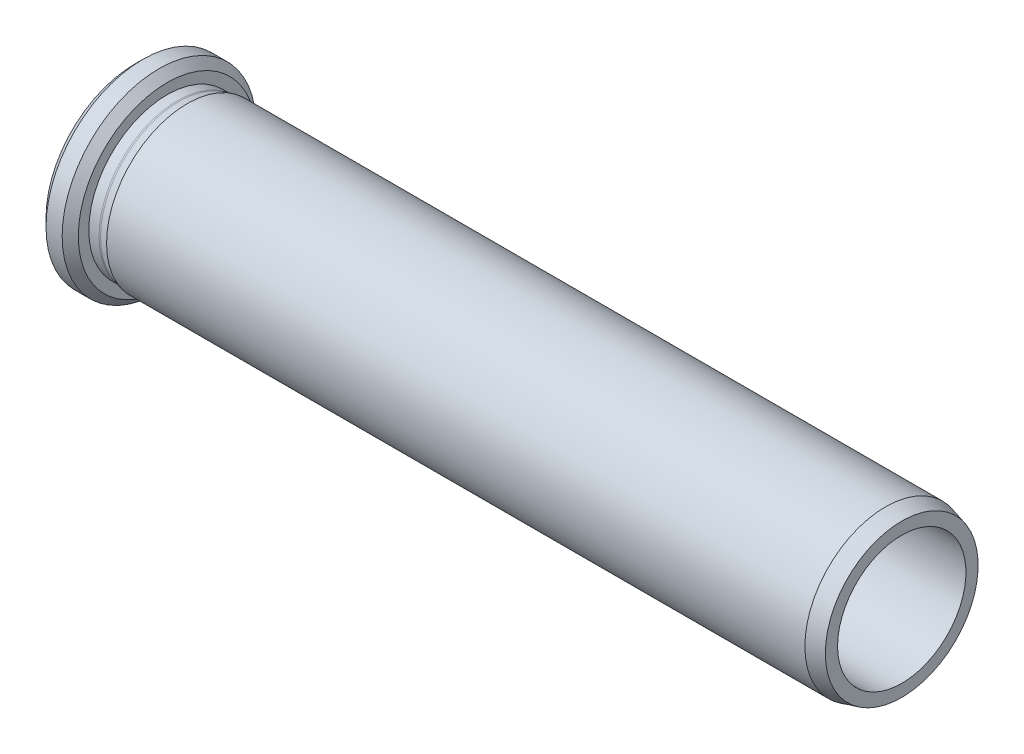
ISO-10303-21;
HEADER;
FILE_DESCRIPTION(('STEP AP214'),'2;1');
FILE_NAME('part.step','',(''),(''),'','','');
FILE_SCHEMA(('AUTOMOTIVE_DESIGN { 1 0 10303 214 1 1 1 1 }'));
ENDSEC;
DATA;
#1=APPLICATION_CONTEXT('core data for automotive mechanical design processes');
#2=APPLICATION_PROTOCOL_DEFINITION('international standard','automotive_design',2000,#1);
#3=PRODUCT_CONTEXT('',#1,'mechanical');
#4=PRODUCT('Part','Part','',(#3));
#5=PRODUCT_RELATED_PRODUCT_CATEGORY('part','',(#4));
#6=PRODUCT_DEFINITION_FORMATION('','',#4);
#7=PRODUCT_DEFINITION_CONTEXT('part definition',#1,'design');
#8=PRODUCT_DEFINITION('design','',#6,#7);
#9=PRODUCT_DEFINITION_SHAPE('','',#8);
#10=(LENGTH_UNIT() NAMED_UNIT(*) SI_UNIT(.MILLI.,.METRE.));
#11=(NAMED_UNIT(*) PLANE_ANGLE_UNIT() SI_UNIT($,.RADIAN.));
#12=(NAMED_UNIT(*) SI_UNIT($,.STERADIAN.) SOLID_ANGLE_UNIT());
#13=UNCERTAINTY_MEASURE_WITH_UNIT(LENGTH_MEASURE(1.E-05),#10,'distance_accuracy_value','');
#14=(GEOMETRIC_REPRESENTATION_CONTEXT(3) GLOBAL_UNCERTAINTY_ASSIGNED_CONTEXT((#13)) GLOBAL_UNIT_ASSIGNED_CONTEXT((#10,
#11,#12)) REPRESENTATION_CONTEXT('',''));
#15=CARTESIAN_POINT('',(0.,0.,0.));
#16=DIRECTION('',(0.,0.,1.));
#17=DIRECTION('',(1.,0.,0.));
#18=AXIS2_PLACEMENT_3D('',#15,#16,#17);
#19=CARTESIAN_POINT('',(30.8004766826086,7.95,0.));
#20=DIRECTION('',(1.,0.,0.));
#21=DIRECTION('',(0.,0.,-1.));
#22=AXIS2_PLACEMENT_3D('',#19,#20,#21);
#23=PLANE('',#22);
#24=CARTESIAN_POINT('',(30.8004766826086,0.,0.));
#25=DIRECTION('',(-1.,0.,0.));
#26=DIRECTION('',(0.,0.,1.));
#27=AXIS2_PLACEMENT_3D('',#24,#25,#26);
#28=CIRCLE('',#27,7.95);
#29=CARTESIAN_POINT('',(30.8004766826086,0.,7.95));
#30=VERTEX_POINT('',#29);
#31=EDGE_CURVE('E64',#30,#30,#28,.T.);
#32=ORIENTED_EDGE('',*,*,#31,.F.);
#33=EDGE_LOOP('',(#32));
#34=FACE_BOUND('',#33,.T.);
#35=CARTESIAN_POINT('',(30.8004766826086,0.,0.));
#36=DIRECTION('',(-1.,0.,0.));
#37=DIRECTION('',(0.,0.,1.));
#38=AXIS2_PLACEMENT_3D('',#35,#36,#37);
#39=CIRCLE('',#38,8.);
#40=CARTESIAN_POINT('',(30.8004766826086,0.,8.));
#41=VERTEX_POINT('',#40);
#42=EDGE_CURVE('E40',#41,#41,#39,.T.);
#43=ORIENTED_EDGE('',*,*,#42,.T.);
#44=EDGE_LOOP('',(#43));
#45=FACE_BOUND('',#44,.T.);
#46=ADVANCED_FACE('F14',(#34,#45),#23,.F.);
#47=CARTESIAN_POINT('',(0.,0.,0.));
#48=DIRECTION('',(-1.,0.,0.));
#49=DIRECTION('',(0.,0.,1.));
#50=AXIS2_PLACEMENT_3D('',#47,#48,#49);
#51=CYLINDRICAL_SURFACE('',#50,8.);
#52=CARTESIAN_POINT('',(-17.6995233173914,0.,0.));
#53=DIRECTION('',(1.,0.,0.));
#54=DIRECTION('',(0.,0.,-1.));
#55=AXIS2_PLACEMENT_3D('',#52,#53,#54);
#56=CIRCLE('',#55,8.);
#57=CARTESIAN_POINT('',(-17.6995233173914,0.,-8.));
#58=VERTEX_POINT('',#57);
#59=EDGE_CURVE('E29',#58,#58,#56,.F.);
#60=ORIENTED_EDGE('',*,*,#59,.T.);
#61=EDGE_LOOP('',(#60));
#62=FACE_BOUND('',#61,.T.);
#63=ORIENTED_EDGE('',*,*,#42,.F.);
#64=EDGE_LOOP('',(#63));
#65=FACE_BOUND('',#64,.T.);
#66=ADVANCED_FACE('F72',(#62,#65),#51,.F.);
#67=CARTESIAN_POINT('',(-19.1995233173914,12.,0.));
#68=DIRECTION('',(1.,0.,0.));
#69=DIRECTION('',(0.,0.,-1.));
#70=AXIS2_PLACEMENT_3D('',#67,#68,#69);
#71=PLANE('',#70);
#72=CARTESIAN_POINT('',(-19.1995233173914,0.,0.));
#73=DIRECTION('',(1.,0.,0.));
#74=DIRECTION('',(0.,0.,-1.));
#75=AXIS2_PLACEMENT_3D('',#72,#73,#74);
#76=CIRCLE('',#75,9.5);
#77=CARTESIAN_POINT('',(-19.1995233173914,0.,-9.5));
#78=VERTEX_POINT('',#77);
#79=EDGE_CURVE('E25',#78,#78,#76,.T.);
#80=ORIENTED_EDGE('',*,*,#79,.T.);
#81=EDGE_LOOP('',(#80));
#82=FACE_BOUND('',#81,.T.);
#83=CARTESIAN_POINT('',(-19.1995233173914,0.,0.));
#84=DIRECTION('',(1.,0.,0.));
#85=DIRECTION('',(0.,0.,-1.));
#86=AXIS2_PLACEMENT_3D('',#83,#84,#85);
#87=CIRCLE('',#86,11.);
#88=CARTESIAN_POINT('',(-19.1995233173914,0.,-11.));
#89=VERTEX_POINT('',#88);
#90=EDGE_CURVE('E37',#89,#89,#87,.F.);
#91=ORIENTED_EDGE('',*,*,#90,.T.);
#92=EDGE_LOOP('',(#91));
#93=FACE_BOUND('',#92,.T.);
#94=ADVANCED_FACE('F77',(#82,#93),#71,.F.);
#95=CARTESIAN_POINT('',(0.,0.,0.));
#96=DIRECTION('',(-1.,0.,0.));
#97=DIRECTION('',(0.,0.,1.));
#98=AXIS2_PLACEMENT_3D('',#95,#96,#97);
#99=CYLINDRICAL_SURFACE('',#98,12.);
#100=CARTESIAN_POINT('',(-16.1995233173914,0.,0.));
#101=DIRECTION('',(-1.,0.,0.));
#102=DIRECTION('',(0.,0.,1.));
#103=AXIS2_PLACEMENT_3D('',#100,#101,#102);
#104=CIRCLE('',#103,12.);
#105=CARTESIAN_POINT('',(-16.1995233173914,0.,12.));
#106=VERTEX_POINT('',#105);
#107=EDGE_CURVE('E21',#106,#106,#104,.T.);
#108=ORIENTED_EDGE('',*,*,#107,.T.);
#109=EDGE_LOOP('',(#108));
#110=FACE_BOUND('',#109,.T.);
#111=CARTESIAN_POINT('',(-18.1995233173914,0.,0.));
#112=DIRECTION('',(1.,0.,0.));
#113=DIRECTION('',(0.,0.,-1.));
#114=AXIS2_PLACEMENT_3D('',#111,#112,#113);
#115=CIRCLE('',#114,12.);
#116=CARTESIAN_POINT('',(-18.1995233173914,0.,-12.));
#117=VERTEX_POINT('',#116);
#118=EDGE_CURVE('E34',#117,#117,#115,.T.);
#119=ORIENTED_EDGE('',*,*,#118,.T.);
#120=EDGE_LOOP('',(#119));
#121=FACE_BOUND('',#120,.T.);
#122=ADVANCED_FACE('F85',(#110,#121),#99,.T.);
#123=CARTESIAN_POINT('',(-15.1995233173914,12.,0.));
#124=DIRECTION('',(-1.,0.,0.));
#125=DIRECTION('',(0.,0.,1.));
#126=AXIS2_PLACEMENT_3D('',#123,#124,#125);
#127=PLANE('',#126);
#128=CARTESIAN_POINT('',(-15.1995233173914,0.,0.));
#129=DIRECTION('',(-1.,0.,0.));
#130=DIRECTION('',(0.,0.,1.));
#131=AXIS2_PLACEMENT_3D('',#128,#129,#130);
#132=CIRCLE('',#131,11.);
#133=CARTESIAN_POINT('',(-15.1995233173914,0.,11.));
#134=VERTEX_POINT('',#133);
#135=EDGE_CURVE('E9',#134,#134,#132,.F.);
#136=ORIENTED_EDGE('',*,*,#135,.T.);
#137=EDGE_LOOP('',(#136));
#138=FACE_BOUND('',#137,.T.);
#139=CARTESIAN_POINT('',(-15.1995233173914,0.,0.));
#140=DIRECTION('',(-1.,0.,0.));
#141=DIRECTION('',(0.,0.,1.));
#142=AXIS2_PLACEMENT_3D('',#139,#140,#141);
#143=CIRCLE('',#142,9.7);
#144=CARTESIAN_POINT('',(-15.1995233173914,0.,9.7));
#145=VERTEX_POINT('',#144);
#146=EDGE_CURVE('E43',#145,#145,#143,.T.);
#147=ORIENTED_EDGE('',*,*,#146,.T.);
#148=EDGE_LOOP('',(#147));
#149=FACE_BOUND('',#148,.T.);
#150=ADVANCED_FACE('F124',(#138,#149),#127,.F.);
#151=CARTESIAN_POINT('',(0.,0.,0.));
#152=DIRECTION('',(-1.,0.,0.));
#153=DIRECTION('',(0.,0.,1.));
#154=AXIS2_PLACEMENT_3D('',#151,#152,#153);
#155=CYLINDRICAL_SURFACE('',#154,9.7);
#156=ORIENTED_EDGE('',*,*,#146,.F.);
#157=EDGE_LOOP('',(#156));
#158=FACE_BOUND('',#157,.T.);
#159=CARTESIAN_POINT('',(-13.924460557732,0.,0.));
#160=DIRECTION('',(-1.,0.,0.));
#161=DIRECTION('',(0.,0.,1.));
#162=AXIS2_PLACEMENT_3D('',#159,#160,#161);
#163=CIRCLE('',#162,9.7);
#164=CARTESIAN_POINT('',(-13.924460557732,0.,9.7));
#165=VERTEX_POINT('',#164);
#166=EDGE_CURVE('E46',#165,#165,#163,.T.);
#167=ORIENTED_EDGE('',*,*,#166,.T.);
#168=EDGE_LOOP('',(#167));
#169=FACE_BOUND('',#168,.T.);
#170=ADVANCED_FACE('F129',(#158,#169),#155,.T.);
#171=CARTESIAN_POINT('',(-13.924460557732,0.,0.));
#172=DIRECTION('',(-1.,0.,0.));
#173=DIRECTION('',(0.,0.,1.));
#174=AXIS2_PLACEMENT_3D('',#171,#172,#173);
#175=TOROIDAL_SURFACE('',#174,10.5,0.8);
#176=ORIENTED_EDGE('',*,*,#166,.F.);
#177=EDGE_LOOP('',(#176));
#178=FACE_BOUND('',#177,.T.);
#179=CARTESIAN_POINT('',(-13.71740532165,0.,0.));
#180=DIRECTION('',(-1.,0.,0.));
#181=DIRECTION('',(0.,0.,1.));
#182=AXIS2_PLACEMENT_3D('',#179,#180,#181);
#183=CIRCLE('',#182,9.72725933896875);
#184=CARTESIAN_POINT('',(-13.71740532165,0.,9.72725933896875));
#185=VERTEX_POINT('',#184);
#186=EDGE_CURVE('E49',#185,#185,#183,.T.);
#187=ORIENTED_EDGE('',*,*,#186,.T.);
#188=EDGE_LOOP('',(#187));
#189=FACE_BOUND('',#188,.T.);
#190=ADVANCED_FACE('F189',(#178,#189),#175,.F.);
#191=CARTESIAN_POINT('',(-12.6995233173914,0.,0.));
#192=DIRECTION('',(1.,0.,0.));
#193=DIRECTION('',(0.,0.,-1.));
#194=AXIS2_PLACEMENT_3D('',#191,#192,#193);
#195=CONICAL_SURFACE('',#194,10.,0.261799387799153);
#196=ORIENTED_EDGE('',*,*,#186,.F.);
#197=EDGE_LOOP('',(#196));
#198=FACE_BOUND('',#197,.T.);
#199=CARTESIAN_POINT('',(-12.6995233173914,0.,0.));
#200=DIRECTION('',(-1.,0.,0.));
#201=DIRECTION('',(0.,0.,1.));
#202=AXIS2_PLACEMENT_3D('',#199,#200,#201);
#203=CIRCLE('',#202,10.);
#204=CARTESIAN_POINT('',(-12.6995233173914,0.,10.));
#205=VERTEX_POINT('',#204);
#206=EDGE_CURVE('E52',#205,#205,#203,.T.);
#207=ORIENTED_EDGE('',*,*,#206,.T.);
#208=EDGE_LOOP('',(#207));
#209=FACE_BOUND('',#208,.T.);
#210=ADVANCED_FACE('F179',(#198,#209),#195,.T.);
#211=CARTESIAN_POINT('',(0.,0.,0.));
#212=DIRECTION('',(-1.,0.,0.));
#213=DIRECTION('',(0.,0.,1.));
#214=AXIS2_PLACEMENT_3D('',#211,#212,#213);
#215=CYLINDRICAL_SURFACE('',#214,10.);
#216=ORIENTED_EDGE('',*,*,#206,.F.);
#217=EDGE_LOOP('',(#216));
#218=FACE_BOUND('',#217,.T.);
#219=CARTESIAN_POINT('',(73.8004766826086,0.,0.));
#220=DIRECTION('',(-1.,0.,0.));
#221=DIRECTION('',(0.,0.,1.));
#222=AXIS2_PLACEMENT_3D('',#219,#220,#221);
#223=CIRCLE('',#222,10.);
#224=CARTESIAN_POINT('',(73.8004766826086,0.,10.));
#225=VERTEX_POINT('',#224);
#226=EDGE_CURVE('E55',#225,#225,#223,.T.);
#227=ORIENTED_EDGE('',*,*,#226,.T.);
#228=EDGE_LOOP('',(#227));
#229=FACE_BOUND('',#228,.T.);
#230=ADVANCED_FACE('F169',(#218,#229),#215,.T.);
#231=CARTESIAN_POINT('',(75.8004766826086,0.,0.));
#232=DIRECTION('',(-1.,0.,0.));
#233=DIRECTION('',(0.,0.,1.));
#234=AXIS2_PLACEMENT_3D('',#231,#232,#233);
#235=CONICAL_SURFACE('',#234,9.46410161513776,0.261799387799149);
#236=ORIENTED_EDGE('',*,*,#226,.F.);
#237=EDGE_LOOP('',(#236));
#238=FACE_BOUND('',#237,.T.);
#239=CARTESIAN_POINT('',(75.8004766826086,0.,0.));
#240=DIRECTION('',(-1.,0.,0.));
#241=DIRECTION('',(0.,0.,1.));
#242=AXIS2_PLACEMENT_3D('',#239,#240,#241);
#243=CIRCLE('',#242,9.46410161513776);
#244=CARTESIAN_POINT('',(75.8004766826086,0.,9.46410161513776));
#245=VERTEX_POINT('',#244);
#246=EDGE_CURVE('E58',#245,#245,#243,.T.);
#247=ORIENTED_EDGE('',*,*,#246,.T.);
#248=EDGE_LOOP('',(#247));
#249=FACE_BOUND('',#248,.T.);
#250=ADVANCED_FACE('F159',(#238,#249),#235,.T.);
#251=CARTESIAN_POINT('',(75.8004766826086,9.46410161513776,0.));
#252=DIRECTION('',(-1.,0.,0.));
#253=DIRECTION('',(0.,0.,1.));
#254=AXIS2_PLACEMENT_3D('',#251,#252,#253);
#255=PLANE('',#254);
#256=ORIENTED_EDGE('',*,*,#246,.F.);
#257=EDGE_LOOP('',(#256));
#258=FACE_BOUND('',#257,.T.);
#259=CARTESIAN_POINT('',(75.8004766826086,0.,0.));
#260=DIRECTION('',(-1.,0.,0.));
#261=DIRECTION('',(0.,0.,1.));
#262=AXIS2_PLACEMENT_3D('',#259,#260,#261);
#263=CIRCLE('',#262,7.95);
#264=CARTESIAN_POINT('',(75.8004766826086,0.,7.95));
#265=VERTEX_POINT('',#264);
#266=EDGE_CURVE('E61',#265,#265,#263,.T.);
#267=ORIENTED_EDGE('',*,*,#266,.T.);
#268=EDGE_LOOP('',(#267));
#269=FACE_BOUND('',#268,.T.);
#270=ADVANCED_FACE('F148',(#258,#269),#255,.F.);
#271=CARTESIAN_POINT('',(0.,0.,0.));
#272=DIRECTION('',(-1.,0.,0.));
#273=DIRECTION('',(0.,0.,1.));
#274=AXIS2_PLACEMENT_3D('',#271,#272,#273);
#275=CYLINDRICAL_SURFACE('',#274,7.95);
#276=ORIENTED_EDGE('',*,*,#266,.F.);
#277=EDGE_LOOP('',(#276));
#278=FACE_BOUND('',#277,.T.);
#279=ORIENTED_EDGE('',*,*,#31,.T.);
#280=EDGE_LOOP('',(#279));
#281=FACE_BOUND('',#280,.T.);
#282=ADVANCED_FACE('F68',(#278,#281),#275,.F.);
#283=CARTESIAN_POINT('',(-19.1995233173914,0.,0.));
#284=DIRECTION('',(1.,0.,0.));
#285=DIRECTION('',(0.,0.,-1.));
#286=AXIS2_PLACEMENT_3D('',#283,#284,#285);
#287=CONICAL_SURFACE('',#286,11.,0.785398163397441);
#288=ORIENTED_EDGE('',*,*,#118,.F.);
#289=EDGE_LOOP('',(#288));
#290=FACE_BOUND('',#289,.T.);
#291=ORIENTED_EDGE('',*,*,#90,.F.);
#292=EDGE_LOOP('',(#291));
#293=FACE_BOUND('',#292,.T.);
#294=ADVANCED_FACE('F90',(#290,#293),#287,.T.);
#295=CARTESIAN_POINT('',(-17.6995233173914,0.,0.));
#296=DIRECTION('',(1.,0.,0.));
#297=DIRECTION('',(0.,0.,-1.));
#298=AXIS2_PLACEMENT_3D('',#295,#296,#297);
#299=TOROIDAL_SURFACE('',#298,9.5,1.5);
#300=ORIENTED_EDGE('',*,*,#79,.F.);
#301=EDGE_LOOP('',(#300));
#302=FACE_BOUND('',#301,.T.);
#303=ORIENTED_EDGE('',*,*,#59,.F.);
#304=EDGE_LOOP('',(#303));
#305=FACE_BOUND('',#304,.T.);
#306=ADVANCED_FACE('F92',(#302,#305),#299,.T.);
#307=CARTESIAN_POINT('',(-16.1995233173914,0.,0.));
#308=DIRECTION('',(-1.,0.,0.));
#309=DIRECTION('',(0.,0.,1.));
#310=AXIS2_PLACEMENT_3D('',#307,#308,#309);
#311=CONICAL_SURFACE('',#310,12.,0.785398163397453);
#312=ORIENTED_EDGE('',*,*,#135,.F.);
#313=EDGE_LOOP('',(#312));
#314=FACE_BOUND('',#313,.T.);
#315=ORIENTED_EDGE('',*,*,#107,.F.);
#316=EDGE_LOOP('',(#315));
#317=FACE_BOUND('',#316,.T.);
#318=ADVANCED_FACE('F16',(#314,#317),#311,.T.);
#319=CLOSED_SHELL('',(#46,#66,#94,#122,#150,#170,#190,#210,#230,#250,#270,#282,#294,#306,#318));
#320=MANIFOLD_SOLID_BREP('B1',#319);
#321=ADVANCED_BREP_SHAPE_REPRESENTATION('',(#18,#320),#14);
#322=SHAPE_DEFINITION_REPRESENTATION(#9,#321);
ENDSEC;
END-ISO-10303-21;
